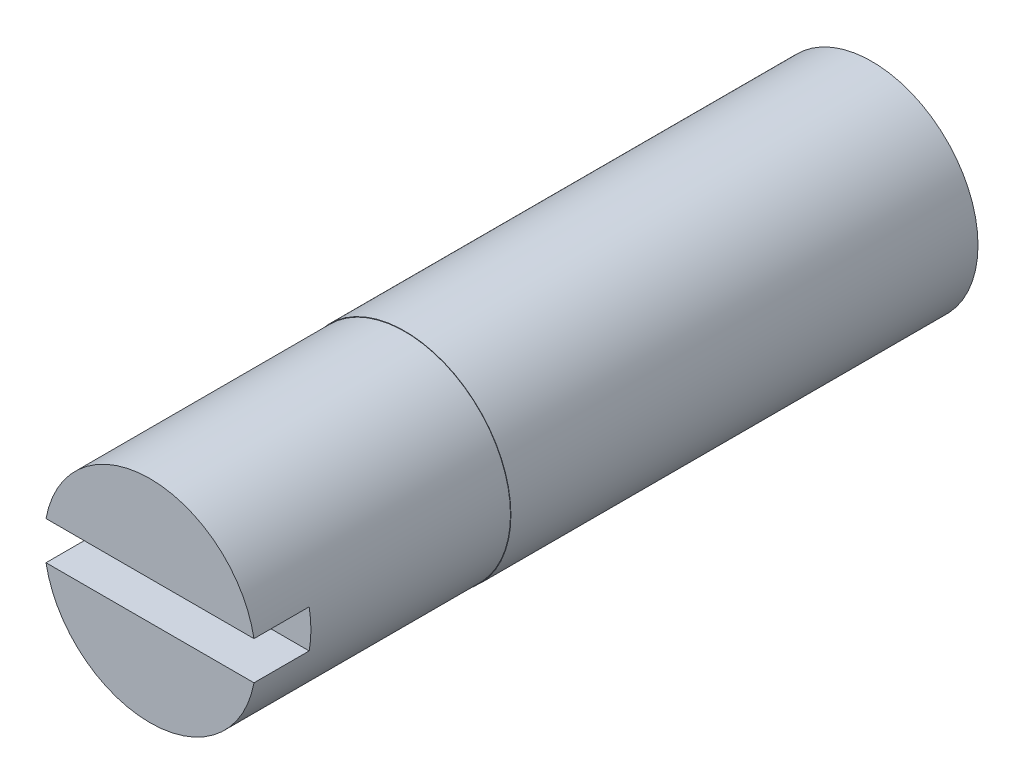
from build123d import *

# Parameters (mm, degrees)
SKETCH_1_R          = 2.49
EXTRUDE_1_DEPTH     = 6
SKETCH_8_W          = 5
SKETCH_8_H          = 0.9
CUT_EXTRUDE_2_DEPTH = 1.3
SKETCH_9_R          = 2.5
EXTRUDE_2_DEPTH     = 11


with BuildPart() as part:
    # Sketch 1 → Extrude 1 (new body)
    with BuildSketch(Plane.XY):
        Circle(SKETCH_1_R)
    extrude(amount=EXTRUDE_1_DEPTH)

    # Sketch 8 → Cut-Extrude 2 (cut)
    with BuildSketch(Plane.XY.offset(6)):
        Rectangle(SKETCH_8_W, SKETCH_8_H)
    extrude(amount=-CUT_EXTRUDE_2_DEPTH, mode=Mode.SUBTRACT)

    # Sketch 9 → Extrude 2 (add)
    with BuildSketch(Plane(origin=(0, 0, 0), x_dir=(-1, 0, 0), z_dir=(0, 0, -1))):
        Circle(SKETCH_9_R)
    extrude(amount=EXTRUDE_2_DEPTH)


solid = part.part
